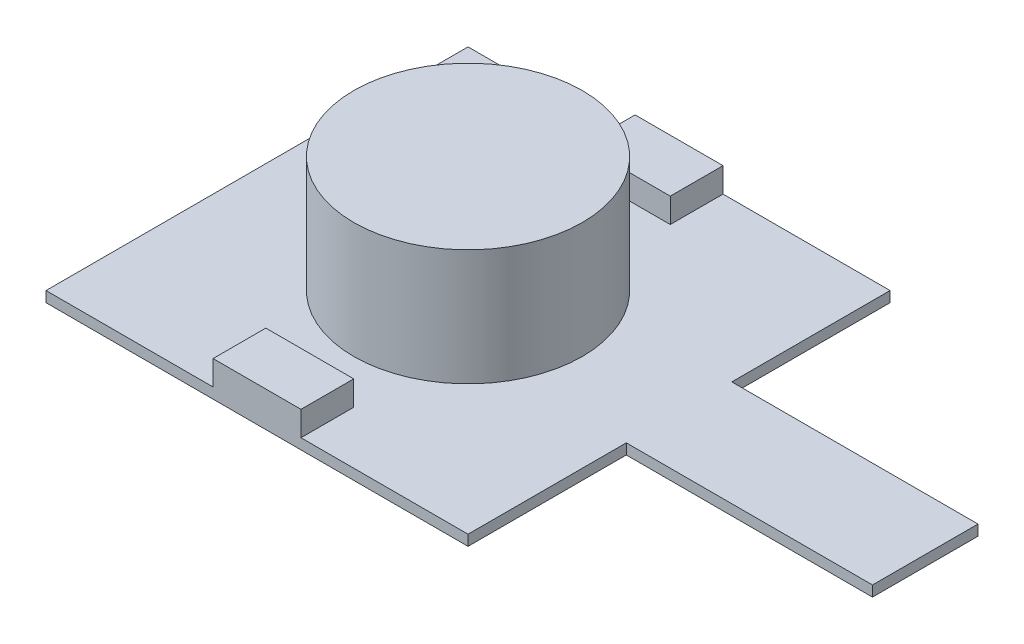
from build123d import *

# Parameters (mm, degrees)
SKETCH1_R           = 3.25
BOSS_EXTRUDE1_DEPTH = 0.3
SKETCH1_3_W         = 2.5
SKETCH1_3_H         = 1.5
BOSS_EXTRUDE2_DEPTH = 1
SKETCH1_4_R         = 3.25
BOSS_EXTRUDE3_DEPTH = 3.6


with BuildPart() as part:
    # Sketch1 → Boss-Extrude1 (new body)
    with BuildSketch(Plane(origin=(0, 0, 0), x_dir=(1, 0, 0), z_dir=(0, 1, 0))):
        Polygon((0, 12), (0, 0), (4.75, 0), (4.75, 1.5), (7.25, 1.5), (7.25, 0), (12, 0), (12, 4.5), (19, 4.5), (19, 7.5), (12, 7.5), (12, 12), (7.25, 12), (7.25, 10.5), (4.75, 10.5), (4.75, 12), align=None)
        with Locations(Location((6, 6, 0), (0, 0, 270))):
            Circle(SKETCH1_R, mode=Mode.SUBTRACT)
    extrude(amount=BOSS_EXTRUDE1_DEPTH)

    # Sketch1_3 → Boss-Extrude2 (add)
    with BuildSketch(Plane(origin=(0, 0, 0), x_dir=(1, 0, 0), z_dir=(0, 1, 0))):
        with Locations((6, 0.75)):
            Rectangle(SKETCH1_3_W, SKETCH1_3_H)
        with Locations((6, 11.25)):
            Rectangle(SKETCH1_3_W, SKETCH1_3_H)
    extrude(amount=BOSS_EXTRUDE2_DEPTH)

    # Sketch1_4 → Boss-Extrude3 (add)
    with BuildSketch(Plane(origin=(0, 0, 0), x_dir=(1, 0, 0), z_dir=(0, 1, 0))):
        with Locations(Location((6, 6, 0), (0, 0, 270))):
            Circle(SKETCH1_4_R)
    extrude(amount=BOSS_EXTRUDE3_DEPTH)


solid = part.part
